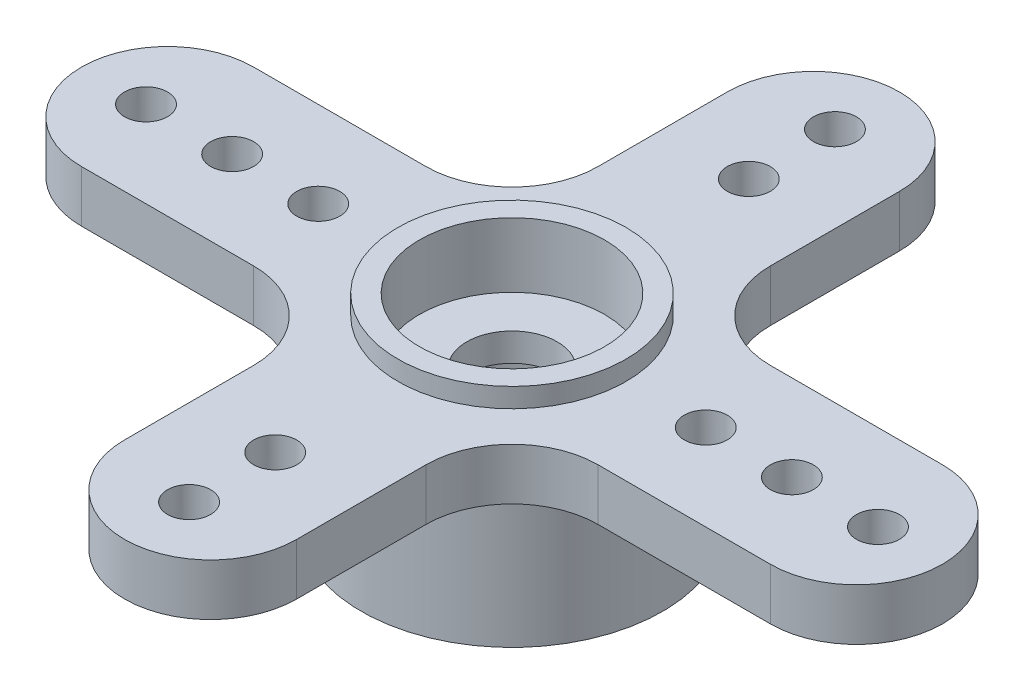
from build123d import *

# Parameters (mm, degrees)
F_1_0_1_DIAMETER_HOLE1_AT_2_COUNT = 2
F_1_0_1_DIAMETER_HOLE1_AT_2_PITCH = 4
F_1_0_1_DIAMETER_HOLE1_AT_3_COUNT = 2
F_1_0_1_DIAMETER_HOLE1_AT_3_PITCH = 2
F_1_0_1_DIAMETER_HOLE1_AT_4_COUNT = 2
F_1_0_1_DIAMETER_HOLE1_AT_4_PITCH = 4
F_1_0_1_DIAMETER_HOLE1_AT_5_COUNT = 2
F_1_0_1_DIAMETER_HOLE1_AT_5_PITCH = 6.5
CIRPATTERN1_COUNT                 = 2
F_1_0_1_DIAMETER_HOLE2_AT_2_COUNT = 2
F_1_0_1_DIAMETER_HOLE2_AT_2_PITCH = 2
F_1_0_1_DIAMETER_HOLE2_AT_3_COUNT = 2
F_1_0_1_DIAMETER_HOLE2_AT_3_PITCH = 5.5
CIRPATTERN2_COUNT                 = 2
CUT_EXTRUDE5_DEPTH                = 36.603932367
CUT_EXTRUDE5_DEPTH_BACK           = 36.603932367
SKETCH9_OUTSIDE_W                 = 66.172
SKETCH9_OUTSIDE_H                 = 66.172


with BuildPart() as part:
    # Sketch1 → Revolve1 (revolve)
    with BuildSketch(Plane.XY, mode=Mode.PRIVATE) as revolve1_sk:
        Polygon((1.05, 0), (2.25, 0), (2.25, -2.5), (3.5, -2.5), (3.5, 0.5), (25, 0.5), (25, 1.7), (2.65, 1.7), (2.65, 2.15), (2.15, 2.15), (2.15, 0.65), (1.05, 0.65), align=None)
    revolve(revolve1_sk.sketch.rotate(Axis((0, -19.458040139, 0), (0, 1, 0)), 90), axis=Axis((0, -19.458040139, 0), (0, 1, 0)))

    # Sketch2 → 1.0 _1_ Diameter Hole1 (revolve, cut)
    with BuildSketch(Plane(origin=(-8.5, 1.7, 0), x_dir=(0, 0, 1), z_dir=(1, 0, 0))):
        Polygon((0, 0), (0, 387.73043031), (0.5, 387.43), (0.5, 0), align=None)
    f_1_0_1_diameter_hole1 = revolve(axis=Axis((-8.5, 8.05, 0), (0, -1, 0)), mode=Mode.SUBTRACT)

    # 1.0 _1_ Diameter Hole1 at 2: 1.0 _1_ Diameter Hole1 ×2
    with Locations(*[(i * F_1_0_1_DIAMETER_HOLE1_AT_2_PITCH, 0, 0) for i in range(1, F_1_0_1_DIAMETER_HOLE1_AT_2_COUNT)]):
        add(f_1_0_1_diameter_hole1, mode=Mode.SUBTRACT)

    # 1.0 _1_ Diameter Hole1 at 3: 1.0 _1_ Diameter Hole1 ×2
    with Locations(*[(i * F_1_0_1_DIAMETER_HOLE1_AT_3_PITCH, 0, 0) for i in range(1, F_1_0_1_DIAMETER_HOLE1_AT_3_COUNT)]):
        add(f_1_0_1_diameter_hole1, mode=Mode.SUBTRACT)

    # 1.0 _1_ Diameter Hole1 at 4: 1.0 _1_ Diameter Hole1 ×2
    with Locations(*[(-i * F_1_0_1_DIAMETER_HOLE1_AT_4_PITCH, 0, 0) for i in range(1, F_1_0_1_DIAMETER_HOLE1_AT_4_COUNT)]):
        add(f_1_0_1_diameter_hole1, mode=Mode.SUBTRACT)

    # 1.0 _1_ Diameter Hole1 at 5: 1.0 _1_ Diameter Hole1 ×2
    with Locations(*[(-i * F_1_0_1_DIAMETER_HOLE1_AT_5_PITCH, 0, 0) for i in range(1, F_1_0_1_DIAMETER_HOLE1_AT_5_COUNT)]):
        add(f_1_0_1_diameter_hole1, mode=Mode.SUBTRACT)

    # CirPattern1: 1.0 _1_ Diameter Hole1 ×2 about axis
    cirpattern1_axis = Axis((0, 0, 0), (0, 1, 0))
    for i in range(1, CIRPATTERN1_COUNT):
        add(f_1_0_1_diameter_hole1.rotate(cirpattern1_axis, i * 360 / CIRPATTERN1_COUNT), mode=Mode.SUBTRACT)

    # CirPattern1 copy 1 sketch → CirPattern1 copy 1 (revolve, cut)
    with BuildSketch(Plane(origin=(4.5, 1.7, 0), x_dir=(0, 0, -1), z_dir=(-1, 0, 0))):
        Polygon((0, 0), (0, 387.73043031), (0.5, 387.43), (0.5, 0), align=None)
    revolve(axis=Axis((4.5, 8.05, 0), (0, -1, 0)), mode=Mode.SUBTRACT)

    # CirPattern1 copy 2 sketch → CirPattern1 copy 2 (revolve, cut)
    with BuildSketch(Plane(origin=(6.5, 1.7, 0), x_dir=(0, 0, -1), z_dir=(-1, 0, 0))):
        Polygon((0, 0), (0, 387.73043031), (0.5, 387.43), (0.5, 0), align=None)
    revolve(axis=Axis((6.5, 8.05, 0), (0, -1, 0)), mode=Mode.SUBTRACT)

    # CirPattern1 copy 3 sketch → CirPattern1 copy 3 (revolve, cut)
    with BuildSketch(Plane(origin=(12.5, 1.7, 0), x_dir=(0, 0, -1), z_dir=(-1, 0, 0))):
        Polygon((0, 0), (0, 387.73043031), (0.5, 387.43), (0.5, 0), align=None)
    revolve(axis=Axis((12.5, 8.05, 0), (0, -1, 0)), mode=Mode.SUBTRACT)

    # CirPattern1 copy 4 sketch → CirPattern1 copy 4 (revolve, cut)
    with BuildSketch(Plane(origin=(15, 1.7, 0), x_dir=(0, 0, -1), z_dir=(-1, 0, 0))):
        Polygon((0, 0), (0, 387.73043031), (0.5, 387.43), (0.5, 0), align=None)
    revolve(axis=Axis((15, 8.05, 0), (0, -1, 0)), mode=Mode.SUBTRACT)

    # Sketch7 → 1.0 _1_ Diameter Hole2 (revolve, cut)
    with BuildSketch(Plane(origin=(0, 1.7, -5.5), x_dir=(0, 0, 1), z_dir=(1, 0, 0))):
        Polygon((0, 0), (0, 387.73043031), (0.5, 387.43), (0.5, 0), align=None)
    f_1_0_1_diameter_hole2 = revolve(axis=Axis((0, 8.05, -5.5), (0, -1, 0)), mode=Mode.SUBTRACT)

    # 1.0 _1_ Diameter Hole2 at 2: 1.0 _1_ Diameter Hole2 ×2
    with Locations(*[(0, 0, -i * F_1_0_1_DIAMETER_HOLE2_AT_2_PITCH) for i in range(1, F_1_0_1_DIAMETER_HOLE2_AT_2_COUNT)]):
        add(f_1_0_1_diameter_hole2, mode=Mode.SUBTRACT)

    # 1.0 _1_ Diameter Hole2 at 3: 1.0 _1_ Diameter Hole2 ×2
    with Locations(*[(0, 0, -i * F_1_0_1_DIAMETER_HOLE2_AT_3_PITCH) for i in range(1, F_1_0_1_DIAMETER_HOLE2_AT_3_COUNT)]):
        add(f_1_0_1_diameter_hole2, mode=Mode.SUBTRACT)

    # CirPattern2: 1.0 _1_ Diameter Hole2 ×2 about axis
    cirpattern2_axis = Axis((0, 0, 0), (0, 1, 0))
    for i in range(1, CIRPATTERN2_COUNT):
        add(f_1_0_1_diameter_hole2.rotate(cirpattern2_axis, i * 360 / CIRPATTERN2_COUNT), mode=Mode.SUBTRACT)

    # CirPattern2 copy 1 sketch → CirPattern2 copy 1 (revolve, cut)
    with BuildSketch(Plane(origin=(0, 1.7, 7.5), x_dir=(0, 0, -1), z_dir=(-1, 0, 0))):
        Polygon((0, 0), (0, 387.73043031), (0.5, 387.43), (0.5, 0), align=None)
    revolve(axis=Axis((0, 8.05, 7.5), (0, -1, 0)), mode=Mode.SUBTRACT)

    # CirPattern2 copy 2 sketch → CirPattern2 copy 2 (revolve, cut)
    with BuildSketch(Plane(origin=(0, 1.7, 11), x_dir=(0, 0, -1), z_dir=(-1, 0, 0))):
        Polygon((0, 0), (0, 387.73043031), (0.5, 387.43), (0.5, 0), align=None)
    revolve(axis=Axis((0, 8.05, 11), (0, -1, 0)), mode=Mode.SUBTRACT)

    # Sketch9 outside → Cut-Extrude5 (cut, two sides: drawn at the far end of the back side and taken through both)
    with BuildSketch(Plane(origin=(0, 1.7, 0), x_dir=(1, 0, 0), z_dir=(0, 1, 0)).offset(-CUT_EXTRUDE5_DEPTH_BACK)):
        Rectangle(SKETCH9_OUTSIDE_W, SKETCH9_OUTSIDE_H)
        with BuildLine():
            Line((8, 2), (4, 2))
            ThreePointArc((4, 2), (2.585786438, 2.585786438), (2, 4))
            Line((2, 4), (2, 7))
            ThreePointArc((2, 7), (0, 9), (-2, 7))
            Line((-2, 7), (-2, 4))
            ThreePointArc((-2, 4), (-2.585786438, 2.585786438), (-4, 2))
            Line((-4, 2), (-8, 2))
            ThreePointArc((-8, 2), (-10, 0), (-8, -2))
            Line((-8, -2), (-4, -2))
            ThreePointArc((-4, -2), (-2.585786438, -2.585786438), (-2, -4))
            Line((-2, -4), (-2, -7))
            ThreePointArc((-2, -7), (0, -9), (2, -7))
            Line((2, -7), (2, -4))
            ThreePointArc((2, -4), (2.585786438, -2.585786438), (4, -2))
            Line((4, -2), (8, -2))
            ThreePointArc((8, -2), (10, 0), (8, 2))
        make_face(mode=Mode.SUBTRACT)
    extrude(amount=CUT_EXTRUDE5_DEPTH + CUT_EXTRUDE5_DEPTH_BACK, mode=Mode.SUBTRACT)


solid = part.part
